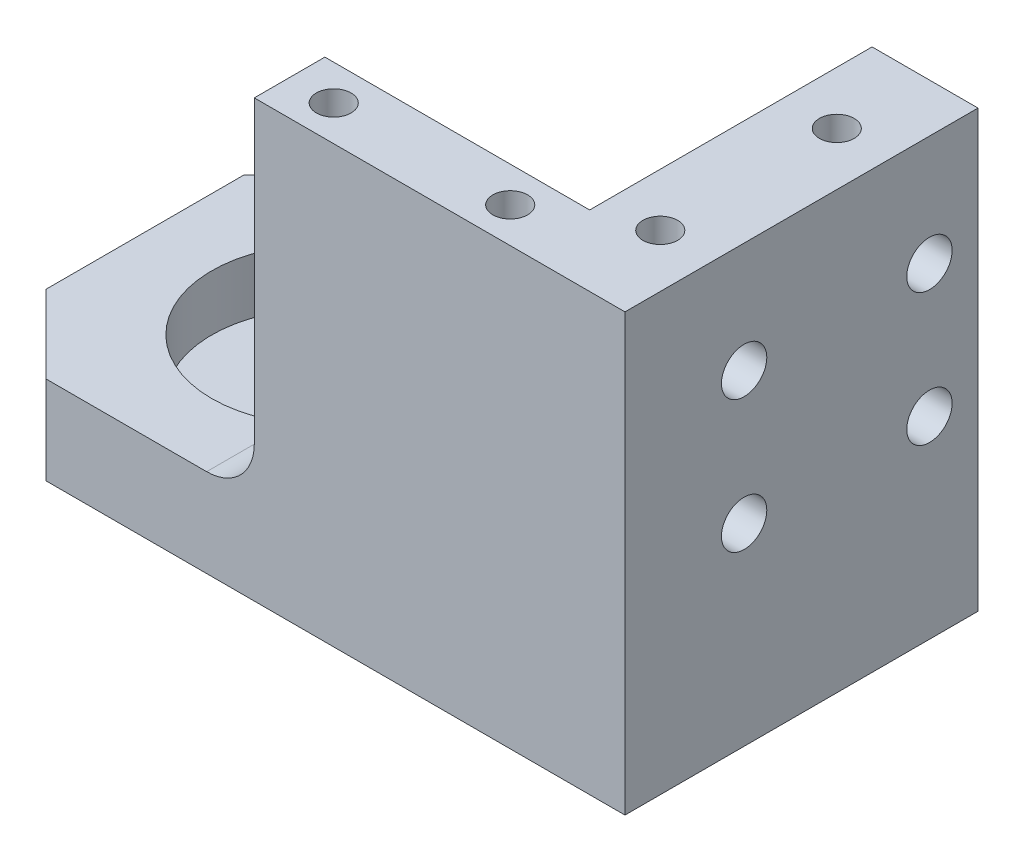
from build123d import *

# Parameters (mm, degrees)
EXTRUDE1_DEPTH                   = 12.7
SKETCH3_W                        = 3.7084
SKETCH3_H                        = 29.6925
CUT_EXTRUDE1_DEPTH               = 1.27
SKETCH4_R                        = 4.99745
CUT_EXTRUDE2_DEPTH               = 2.032
CBORE_FOR_M2_5_SHCS2_D           = 2.9
CBORE_FOR_M2_5_SHCS2_CBORE_D     = 5.5
CBORE_FOR_M2_5_SHCS2_CBORE_DEPTH = 2.35
SKETCH11_W                       = 19.05
SKETCH11_H                       = 24.6125
EXTRUDE2_DEPTH                   = 5.08
SKETCH12_R                       = 3.77063
CUT_EXTRUDE4_DEPTH               = 57.199544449
EXTRUDE3_DEPTH                   = 6.35
CUT_EXTRUDE5_REACH               = 62.765
SKETCH14_R                       = 3.33375
SKETCH17_W                       = 3.7084
SKETCH17_H                       = 36.0425
EXTRUDE4_DEPTH                   = 1.27
CHAMFER1_SIZE                    = 5.588
SKETCH18_W                       = 11.176
SKETCH18_H                       = 2.54
CUT_EXTRUDE7_DEPTH               = 12.7
F_5_40_TAPPED_HOLE1_D            = 2.5781
F_5_40_TAPPED_HOLE1_DEPTH        = 6.985
FILLET1_R                        = 3.429
F_30_0_128500_DIAMETER_HOLE1_D   = 3.2639
SKETCH25_R                       = 4.99745
SKETCH25_R_2                     = 2.9972
EXTRUDE5_DEPTH                   = 5.08
CBORE_FOR_M2_SHCS1_D             = 2.1
CBORE_FOR_M2_SHCS1_DEPTH         = 5.08
CBORE_FOR_M2_SHCS1_CBORE_D       = 3.97
CBORE_FOR_M2_SHCS1_CBORE_DEPTH   = 3
CUT_EXTRUDE14_START              = -20.32
CUT_EXTRUDE14_DEPTH              = 20.32
SKETCH34_W                       = 47.244
SKETCH34_H                       = 5.08
CUT_EXTRUDE15_DEPTH              = 25.4
SKETCH36_R                       = 7.9629
CUT_EXTRUDE16_DEPTH              = 4
BOSS_EXTRUDE2_DEPTH              = 0.393750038
M3X0_5_TAPPED_HOLE1_D            = 2.5
M3X0_5_TAPPED_HOLE1_DEPTH        = 4.50088


with BuildPart() as part:
    # Sketch1 → Extrude1 (new body)
    with BuildSketch(Plane.XY):
        Polygon((-7.62, -5.08), (-47.244, -5.08), (-47.244, 0), (0, 0), (0, -29.6925), (-7.62, -29.6925), align=None)
    extrude1 = extrude(amount=EXTRUDE1_DEPTH)

    # Mirror1: Extrude1 across plane
    add(extrude1.mirror(Plane.XY))

    # Sketch3 → Cut-Extrude1 (cut)
    with BuildSketch(Plane(origin=(0, 0, 0), x_dir=(0, 0, -1), z_dir=(1, 0, 0))):
        with Locations((10.8458, -14.84625)):
            Rectangle(SKETCH3_W, SKETCH3_H)
        with Locations((-10.8458, -14.84625)):
            Rectangle(SKETCH3_W, SKETCH3_H)
    extrude(amount=-CUT_EXTRUDE1_DEPTH, mode=Mode.SUBTRACT)

    # Sketch4 → Cut-Extrude2 (cut)
    with BuildSketch(Plane(origin=(0, 0, 0), x_dir=(-1, 0, 0), z_dir=(0, 1, 0))):
        with Locations(Location((34.47288, 0, 0), (0, 0, 90))):
            Circle(SKETCH4_R)
    extrude(amount=-CUT_EXTRUDE2_DEPTH, mode=Mode.SUBTRACT)

    # CBORE for M2.5 SHCS2 (through all)
    with Locations(Plane.XZ.offset(5.08)):
        with Locations((-37.973, 6.062385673)):
            CounterBoreHole(CBORE_FOR_M2_5_SHCS2_D / 2, CBORE_FOR_M2_5_SHCS2_CBORE_D / 2, CBORE_FOR_M2_5_SHCS2_CBORE_DEPTH)

    # Sketch11 → Extrude2 (add)
    with BuildSketch(Plane.XY.offset(12.7)):
        with Locations((-17.145, -17.38625)):
            Rectangle(SKETCH11_W, SKETCH11_H)
    extrude(amount=-EXTRUDE2_DEPTH)

    # Sketch12 → Cut-Extrude4 (cut, through all)
    with BuildSketch(Plane(origin=(0, -2.032, 0), x_dir=(-1, 0, 0), z_dir=(0, 1, 0))):
        with Locations(Location((34.47288, 0, 0), (0, 0, 90))):
            Circle(SKETCH12_R)
    extrude(amount=-CUT_EXTRUDE4_DEPTH, mode=Mode.SUBTRACT)

    # Sketch13 → Extrude3 (add)
    with BuildSketch(Plane.XZ.offset(29.6925)):
        Polygon((-1.27, -8.9916), (-1.27, -12.7), (-47.244, -12.7), (-47.244, 12.7), (-1.27, 12.7), (-1.27, 8.9916), (0, 8.9916), (0, -8.9916), align=None)
    extrude(amount=EXTRUDE3_DEPTH)

    # Sketch14 → Cut-Extrude5 (cut, up to next)
    with BuildSketch(Plane.XZ.offset(36.0425), mode=Mode.PRIVATE) as cut_extrude5_sk1:
        with Locations(Location((-34.47288, 0, 0), (0, 0, 270))):
            Circle(SKETCH14_R)
    cut_extrude5_tool1 = extrude(cut_extrude5_sk1.sketch, amount=-CUT_EXTRUDE5_REACH, mode=Mode.PRIVATE) & part.part
    add(cut_extrude5_tool1.solids().sort_by_distance((-34.47288, -36.0425, 0))[0], mode=Mode.SUBTRACT)

    # Sketch17 → Extrude4 (add)
    with BuildSketch(Plane(origin=(-1.27, 0, 0), x_dir=(0, 0, -1), z_dir=(1, 0, 0))):
        with Locations((10.8458, -18.02125)):
            Rectangle(SKETCH17_W, SKETCH17_H)
    extrude4 = extrude(amount=EXTRUDE4_DEPTH)

    # Mirror2: Extrude4 across plane
    add(extrude4.mirror(Plane.XY))

    # Chamfer1
    chamfer1_edges = [part.edges().sort_by_distance(p)[0] for p in [
        (-47.244, -2.54, -12.7),
        (-47.244, -2.54, 12.7),
        (-47.244, -32.8675, -12.7),
        (-47.244, -32.8675, 12.7),
    ]]
    chamfer(chamfer1_edges, length=CHAMFER1_SIZE)

    # Sketch18 → Cut-Extrude7 (cut)
    with BuildSketch(Plane.XZ.offset(36.0425)):
        with Locations((-13.208, -11.43)):
            Rectangle(SKETCH18_W, SKETCH18_H)
    extrude(amount=-CUT_EXTRUDE7_DEPTH, mode=Mode.SUBTRACT)

    # 5-40 Tapped Hole1
    with Locations(Plane(origin=(0, 0, -12.7), x_dir=(-1, 0, 0), z_dir=(0, 0, -1))):
        with Locations((23.1902, -32.8675), (4.1402, -32.8675)):
            Hole(F_5_40_TAPPED_HOLE1_D / 2, depth=F_5_40_TAPPED_HOLE1_DEPTH)

    # Fillet1
    fillet1_edges = [part.edges().sort_by_distance(p)[0] for p in [
        (-7.62, -29.6925, -1.27),
        (-7.62, -5.08, -2.54),
        (-26.67, -29.6925, 10.16),
    ]]
    fillet(fillet1_edges, radius=FILLET1_R)

    # 30 _0.128500_ Diameter Hole1 (through all)
    with Locations(Plane(origin=(0, 0, 0), x_dir=(0, 0, -1), z_dir=(1, 0, 0))):
        with Locations((-4.1275, -12.62375), (9.2075, -12.62375), (-4.1275, -22.14875), (9.2075, -22.14875)):
            Hole(F_30_0_128500_DIAMETER_HOLE1_D / 2)

    # Sketch25 → Extrude5 (add)
    with BuildSketch(Plane(origin=(0, 0, 0), x_dir=(-1, 0, 0), z_dir=(0, 1, 0))):
        with Locations((34.47288, 0)):
            Circle(SKETCH25_R)
        with Locations((34.47288, 0)):
            Circle(SKETCH25_R_2, mode=Mode.SUBTRACT)
    extrude(amount=-EXTRUDE5_DEPTH)

    # CBORE for M2 SHCS1
    with Locations(Plane.XZ.offset(5.08)):
        with Locations((-34.47288, 4.99999), (-34.47288, -4.99999)):
            CounterBoreHole(CBORE_FOR_M2_SHCS1_D / 2, CBORE_FOR_M2_SHCS1_CBORE_D / 2, CBORE_FOR_M2_SHCS1_CBORE_DEPTH, depth=CBORE_FOR_M2_SHCS1_DEPTH)

    # Sketch33 → Cut-Extrude14 (cut)
    with BuildSketch(Plane(origin=(0, 0, -12.7), x_dir=(-1, 0, 0), z_dir=(0, 0, -1)).offset(CUT_EXTRUDE14_START)):
        with BuildLine():
            Line((7.62, -8.509), (7.62, -5.08))
            Line((7.62, -5.08), (11.049, -5.08))
            ThreePointArc((11.049, -5.08), (8.624330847, -6.084330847), (7.62, -8.509))
        make_face()
    extrude(amount=CUT_EXTRUDE14_DEPTH, mode=Mode.SUBTRACT)

    # Sketch34 → Cut-Extrude15 (cut)
    with BuildSketch(Plane(origin=(0, 0, -12.7), x_dir=(-1, 0, 0), z_dir=(0, 0, -1))):
        with Locations((23.622, -2.54)):
            Rectangle(SKETCH34_W, SKETCH34_H)
    extrude(amount=-CUT_EXTRUDE15_DEPTH, mode=Mode.SUBTRACT)

    # Sketch36 → Cut-Extrude16 (cut)
    with BuildSketch(Plane(origin=(0, -29.6925, 0), x_dir=(1, 0, 0), z_dir=(0, 1, 0))):
        with Locations(Location((-34.47288, 0, 0), (0, 0, 270))):
            Circle(SKETCH36_R)
    extrude(amount=-CUT_EXTRUDE16_DEPTH, mode=Mode.SUBTRACT)

    # Sketch40 → Boss-Extrude2 (add)
    with BuildSketch(Plane(origin=(0, -5.08, 0), x_dir=(1, 0, 0), z_dir=(0, 1, 0))):
        Polygon((-7.62, -7.62), (-26.67, -7.62), (-26.67, -12.7), (0, -12.7), (0, 12.7), (-7.62, 12.7), align=None)
    extrude(amount=BOSS_EXTRUDE2_DEPTH)

    # M3x0.5 Tapped Hole1
    with Locations(Plane(origin=(0, -4.686249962, 0), x_dir=(1, 0, 0), z_dir=(0, 1, 0))):
        with Locations((-23.495, -10.16), (-10.795, -10.16), (-3.81, -6.35), (-3.81, 6.35)):
            Hole(M3X0_5_TAPPED_HOLE1_D / 2, depth=M3X0_5_TAPPED_HOLE1_DEPTH)


solid = part.part
